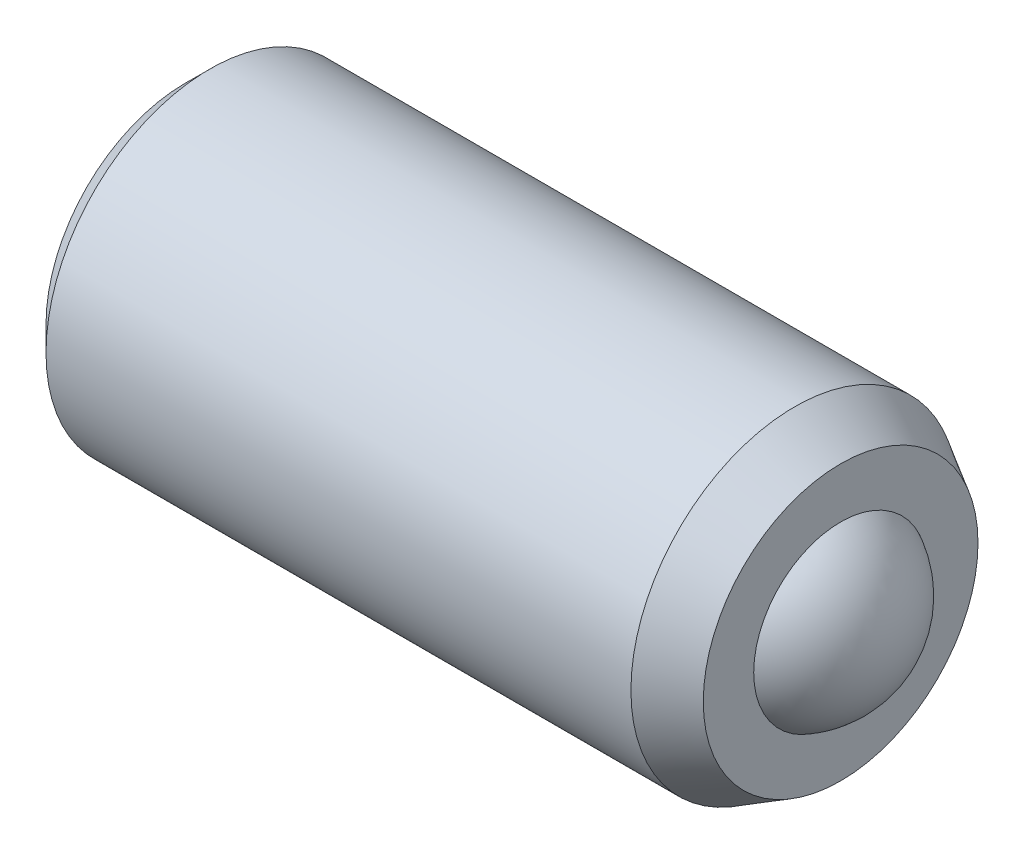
ISO-10303-21;
HEADER;
FILE_DESCRIPTION(('STEP AP214'),'2;1');
FILE_NAME('part.step','',(''),(''),'','','');
FILE_SCHEMA(('AUTOMOTIVE_DESIGN { 1 0 10303 214 1 1 1 1 }'));
ENDSEC;
DATA;
#1=APPLICATION_CONTEXT('core data for automotive mechanical design processes');
#2=APPLICATION_PROTOCOL_DEFINITION('international standard','automotive_design',2000,#1);
#3=PRODUCT_CONTEXT('',#1,'mechanical');
#4=PRODUCT('Part','Part','',(#3));
#5=PRODUCT_RELATED_PRODUCT_CATEGORY('part','',(#4));
#6=PRODUCT_DEFINITION_FORMATION('','',#4);
#7=PRODUCT_DEFINITION_CONTEXT('part definition',#1,'design');
#8=PRODUCT_DEFINITION('design','',#6,#7);
#9=PRODUCT_DEFINITION_SHAPE('','',#8);
#10=(LENGTH_UNIT() NAMED_UNIT(*) SI_UNIT(.MILLI.,.METRE.));
#11=(NAMED_UNIT(*) PLANE_ANGLE_UNIT() SI_UNIT($,.RADIAN.));
#12=(NAMED_UNIT(*) SI_UNIT($,.STERADIAN.) SOLID_ANGLE_UNIT());
#13=UNCERTAINTY_MEASURE_WITH_UNIT(LENGTH_MEASURE(1.E-05),#10,'distance_accuracy_value','');
#14=(GEOMETRIC_REPRESENTATION_CONTEXT(3) GLOBAL_UNCERTAINTY_ASSIGNED_CONTEXT((#13)) GLOBAL_UNIT_ASSIGNED_CONTEXT((#10,
#11,#12)) REPRESENTATION_CONTEXT('',''));
#15=CARTESIAN_POINT('',(0.,0.,0.));
#16=DIRECTION('',(0.,0.,1.));
#17=DIRECTION('',(1.,0.,0.));
#18=AXIS2_PLACEMENT_3D('',#15,#16,#17);
#19=CARTESIAN_POINT('',(4.65,0.,0.));
#20=DIRECTION('',(0.,-1.,0.));
#21=DIRECTION('',(-1.,0.,0.));
#22=AXIS2_PLACEMENT_3D('',#19,#20,#21);
#23=SPHERICAL_SURFACE('',#22,0.75);
#24=CARTESIAN_POINT('',(4.65,-0.749999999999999,0.));
#25=VERTEX_POINT('',#24);
#26=VERTEX_LOOP('',#25);
#27=FACE_BOUND('',#26,.T.);
#28=ADVANCED_FACE('P0_F11',(#27),#23,.T.);
#29=CLOSED_SHELL('',(#28));
#30=MANIFOLD_SOLID_BREP('P0_B1',#29);
#31=CARTESIAN_POINT('',(0.,0.,0.));
#32=DIRECTION('',(1.,0.,0.));
#33=DIRECTION('',(0.,0.,-1.));
#34=AXIS2_PLACEMENT_3D('',#31,#32,#33);
#35=PLANE('',#34);
#36=CARTESIAN_POINT('',(0.,0.,0.));
#37=DIRECTION('',(-1.,0.,0.));
#38=DIRECTION('',(0.,0.,1.));
#39=AXIS2_PLACEMENT_3D('',#36,#37,#38);
#40=CIRCLE('',#39,1.0625);
#41=CARTESIAN_POINT('',(0.,0.,1.0625));
#42=VERTEX_POINT('',#41);
#43=EDGE_CURVE('P1_E10',#42,#42,#40,.T.);
#44=ORIENTED_EDGE('',*,*,#43,.T.);
#45=EDGE_LOOP('',(#44));
#46=FACE_BOUND('',#45,.T.);
#47=ADVANCED_FACE('P1_F15',(#46),#35,.F.);
#48=CARTESIAN_POINT('',(0.1875,0.,0.));
#49=DIRECTION('',(1.,0.,0.));
#50=DIRECTION('',(0.,0.,-1.));
#51=AXIS2_PLACEMENT_3D('',#48,#49,#50);
#52=CONICAL_SURFACE('',#51,1.25,0.785398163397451);
#53=ORIENTED_EDGE('',*,*,#43,.F.);
#54=EDGE_LOOP('',(#53));
#55=FACE_BOUND('',#54,.T.);
#56=CARTESIAN_POINT('',(0.1875,0.,0.));
#57=DIRECTION('',(-1.,0.,0.));
#58=DIRECTION('',(0.,0.,1.));
#59=AXIS2_PLACEMENT_3D('',#56,#57,#58);
#60=CIRCLE('',#59,1.25);
#61=CARTESIAN_POINT('',(0.1875,0.,1.25));
#62=VERTEX_POINT('',#61);
#63=EDGE_CURVE('P1_E21',#62,#62,#60,.T.);
#64=ORIENTED_EDGE('',*,*,#63,.T.);
#65=EDGE_LOOP('',(#64));
#66=FACE_BOUND('',#65,.T.);
#67=ADVANCED_FACE('P1_F39',(#55,#66),#52,.T.);
#68=CARTESIAN_POINT('',(0.,0.,0.));
#69=DIRECTION('',(-1.,0.,0.));
#70=DIRECTION('',(0.,0.,1.));
#71=AXIS2_PLACEMENT_3D('',#68,#69,#70);
#72=CYLINDRICAL_SURFACE('',#71,1.25);
#73=ORIENTED_EDGE('',*,*,#63,.F.);
#74=EDGE_LOOP('',(#73));
#75=FACE_BOUND('',#74,.T.);
#76=CARTESIAN_POINT('',(4.65,0.,0.));
#77=DIRECTION('',(-1.,0.,0.));
#78=DIRECTION('',(0.,0.,1.));
#79=AXIS2_PLACEMENT_3D('',#76,#77,#78);
#80=CIRCLE('',#79,1.25);
#81=CARTESIAN_POINT('',(4.65,0.,1.25));
#82=VERTEX_POINT('',#81);
#83=EDGE_CURVE('P1_E52',#82,#82,#80,.T.);
#84=ORIENTED_EDGE('',*,*,#83,.T.);
#85=EDGE_LOOP('',(#84));
#86=FACE_BOUND('',#85,.T.);
#87=ADVANCED_FACE('P1_F45',(#75,#86),#72,.T.);
#88=CARTESIAN_POINT('',(5.,0.,0.));
#89=DIRECTION('',(-1.,0.,0.));
#90=DIRECTION('',(0.,0.,1.));
#91=AXIS2_PLACEMENT_3D('',#88,#89,#90);
#92=CONICAL_SURFACE('',#91,1.04792740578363,0.523598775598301);
#93=ORIENTED_EDGE('',*,*,#83,.F.);
#94=EDGE_LOOP('',(#93));
#95=FACE_BOUND('',#94,.T.);
#96=CARTESIAN_POINT('',(5.,0.,0.));
#97=DIRECTION('',(-1.,0.,0.));
#98=DIRECTION('',(0.,0.,1.));
#99=AXIS2_PLACEMENT_3D('',#96,#97,#98);
#100=CIRCLE('',#99,1.04792740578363);
#101=CARTESIAN_POINT('',(5.,0.,1.04792740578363));
#102=VERTEX_POINT('',#101);
#103=EDGE_CURVE('P1_E54',#102,#102,#100,.T.);
#104=ORIENTED_EDGE('',*,*,#103,.T.);
#105=EDGE_LOOP('',(#104));
#106=FACE_BOUND('',#105,.T.);
#107=ADVANCED_FACE('P1_F78',(#95,#106),#92,.T.);
#108=CARTESIAN_POINT('',(5.,1.04792740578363,0.));
#109=DIRECTION('',(-1.,0.,0.));
#110=DIRECTION('',(0.,0.,1.));
#111=AXIS2_PLACEMENT_3D('',#108,#109,#110);
#112=PLANE('',#111);
#113=ORIENTED_EDGE('',*,*,#103,.F.);
#114=EDGE_LOOP('',(#113));
#115=FACE_BOUND('',#114,.T.);
#116=CARTESIAN_POINT('',(5.,0.,0.));
#117=DIRECTION('',(-1.,0.,0.));
#118=DIRECTION('',(0.,0.,1.));
#119=AXIS2_PLACEMENT_3D('',#116,#117,#118);
#120=CIRCLE('',#119,0.663324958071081);
#121=CARTESIAN_POINT('',(5.,0.,0.663324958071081));
#122=VERTEX_POINT('',#121);
#123=EDGE_CURVE('P1_E59',#122,#122,#120,.T.);
#124=ORIENTED_EDGE('',*,*,#123,.T.);
#125=EDGE_LOOP('',(#124));
#126=FACE_BOUND('',#125,.T.);
#127=ADVANCED_FACE('P1_F71',(#115,#126),#112,.F.);
#128=CARTESIAN_POINT('',(4.65,0.,0.));
#129=DIRECTION('',(-1.,0.,0.));
#130=DIRECTION('',(0.,1.,0.));
#131=AXIS2_PLACEMENT_3D('',#128,#129,#130);
#132=SPHERICAL_SURFACE('',#131,0.75);
#133=ORIENTED_EDGE('',*,*,#123,.F.);
#134=EDGE_LOOP('',(#133));
#135=FACE_BOUND('',#134,.T.);
#136=CARTESIAN_POINT('',(4.65,0.,0.));
#137=DIRECTION('',(-1.,0.,0.));
#138=DIRECTION('',(0.,0.,1.));
#139=AXIS2_PLACEMENT_3D('',#136,#137,#138);
#140=CIRCLE('',#139,0.750000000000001);
#141=CARTESIAN_POINT('',(4.65,0.,0.750000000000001));
#142=VERTEX_POINT('',#141);
#143=EDGE_CURVE('P1_E62',#142,#142,#140,.T.);
#144=ORIENTED_EDGE('',*,*,#143,.T.);
#145=EDGE_LOOP('',(#144));
#146=FACE_BOUND('',#145,.T.);
#147=ADVANCED_FACE('P1_F34',(#135,#146),#132,.F.);
#148=CARTESIAN_POINT('',(0.,0.,0.));
#149=DIRECTION('',(-1.,0.,0.));
#150=DIRECTION('',(0.,0.,1.));
#151=AXIS2_PLACEMENT_3D('',#148,#149,#150);
#152=CYLINDRICAL_SURFACE('',#151,0.75);
#153=ORIENTED_EDGE('',*,*,#143,.F.);
#154=EDGE_LOOP('',(#153));
#155=FACE_BOUND('',#154,.T.);
#156=CARTESIAN_POINT('',(1.30801270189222,0.,0.));
#157=DIRECTION('',(-1.,0.,0.));
#158=DIRECTION('',(0.,0.,1.));
#159=AXIS2_PLACEMENT_3D('',#156,#157,#158);
#160=CIRCLE('',#159,0.75);
#161=CARTESIAN_POINT('',(1.30801270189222,0.,0.75));
#162=VERTEX_POINT('',#161);
#163=EDGE_CURVE('P1_E65',#162,#162,#160,.T.);
#164=ORIENTED_EDGE('',*,*,#163,.T.);
#165=EDGE_LOOP('',(#164));
#166=FACE_BOUND('',#165,.T.);
#167=ADVANCED_FACE('P1_F26',(#155,#166),#152,.F.);
#168=CARTESIAN_POINT('',(0.875,0.,0.));
#169=DIRECTION('',(1.,0.,0.));
#170=DIRECTION('',(0.,0.,-1.));
#171=AXIS2_PLACEMENT_3D('',#168,#169,#170);
#172=CONICAL_SURFACE('',#171,0.,1.0471975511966);
#173=ORIENTED_EDGE('',*,*,#163,.F.);
#174=EDGE_LOOP('',(#173));
#175=FACE_BOUND('',#174,.T.);
#176=CARTESIAN_POINT('',(0.875,0.,0.));
#177=VERTEX_POINT('',#176);
#178=VERTEX_LOOP('',#177);
#179=FACE_BOUND('',#178,.T.);
#180=ADVANCED_FACE('P1_F24',(#175,#179),#172,.F.);
#181=CLOSED_SHELL('',(#47,#67,#87,#107,#127,#147,#167,#180));
#182=MANIFOLD_SOLID_BREP('P1_B1',#181);
#183=ADVANCED_BREP_SHAPE_REPRESENTATION('',(#18,#30,#182),#14);
#184=SHAPE_DEFINITION_REPRESENTATION(#9,#183);
ENDSEC;
END-ISO-10303-21;
